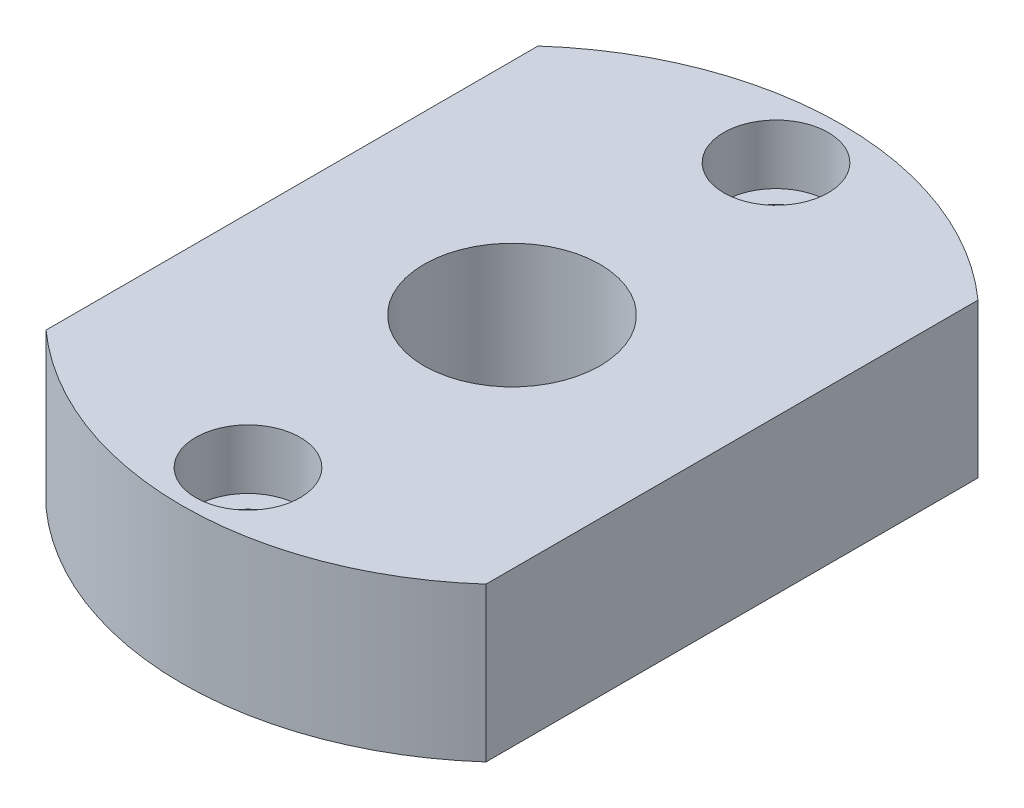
from build123d import *

# Parameters (mm, degrees)
SKETCH_1_R           = 30
EXTRUDE_1_DEPTH      = 14
SKETCH_2_R           = 8
CUT_EXTRUDE_1_DEPTH  = 14
SKETCH_3_R           = 3
CUT_EXTRUDE_2_DEPTH  = 14
SKETCH_4_R           = 4.75
CUT_EXTRUDE_3_DEPTH  = 5.4
SKETCH_5_OUTSIDE_W   = 79.2
SKETCH_5_OUTSIDE_H   = 79.2
SKETCH_5_OUTSIDE_W_2 = 40
SKETCH_5_OUTSIDE_H_2 = 65
CUT_EXTRUDE_4_DEPTH  = 14


with BuildPart() as part:
    # Sketch 1 → Extrude 1 (new body)
    with BuildSketch(Plane(origin=(0, 0, 0), x_dir=(1, 0, 0), z_dir=(0, 1, 0))):
        with Locations(Location((0, 0, 0), (0, 0, 270))):
            Circle(SKETCH_1_R)
    extrude(amount=EXTRUDE_1_DEPTH)

    # Sketch 2 → Cut-Extrude 1 (cut)
    with BuildSketch(Plane(origin=(0, 14, 0), x_dir=(1, 0, 0), z_dir=(0, 1, 0))):
        with Locations(Location((0, 0, 0), (0, 0, 270))):
            Circle(SKETCH_2_R)
    extrude(amount=-CUT_EXTRUDE_1_DEPTH, mode=Mode.SUBTRACT)

    # Sketch 3 → Cut-Extrude 2 (cut)
    with BuildSketch(Plane(origin=(0, 14, 0), x_dir=(1, 0, 0), z_dir=(0, 1, 0))):
        with Locations(Location((0, 24, 0), (0, 0, 270))):
            Circle(SKETCH_3_R)
        with Locations(Location((0, -24, 0), (0, 0, 90))):
            Circle(SKETCH_3_R)
    extrude(amount=-CUT_EXTRUDE_2_DEPTH, mode=Mode.SUBTRACT)

    # Sketch 4 → Cut-Extrude 3 (cut)
    with BuildSketch(Plane(origin=(0, 14, 0), x_dir=(1, 0, 0), z_dir=(0, 1, 0))):
        with Locations(Location((0, 24, 0), (0, 0, 270))):
            Circle(SKETCH_4_R)
        with Locations(Location((0, -24, 0), (0, 0, 270))):
            Circle(SKETCH_4_R)
    extrude(amount=-CUT_EXTRUDE_3_DEPTH, mode=Mode.SUBTRACT)

    # Sketch 5 outside → Cut-Extrude 4 (cut)
    with BuildSketch(Plane(origin=(0, 14, 0), x_dir=(1, 0, 0), z_dir=(0, 1, 0))):
        Rectangle(SKETCH_5_OUTSIDE_W, SKETCH_5_OUTSIDE_H)
        Rectangle(SKETCH_5_OUTSIDE_W_2, SKETCH_5_OUTSIDE_H_2, mode=Mode.SUBTRACT)
    extrude(amount=-CUT_EXTRUDE_4_DEPTH, mode=Mode.SUBTRACT)


solid = part.part
